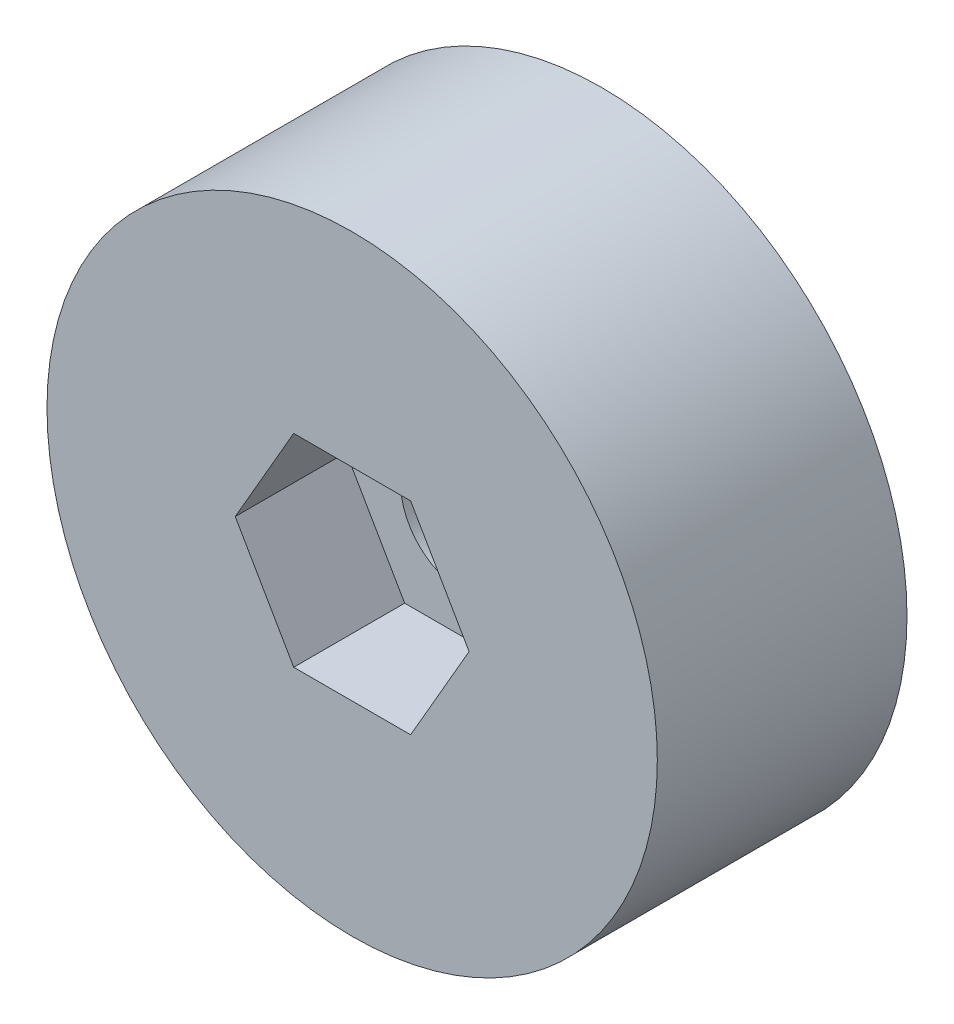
ISO-10303-21;
HEADER;
FILE_DESCRIPTION(('STEP AP214'),'2;1');
FILE_NAME('part.step','',(''),(''),'','','');
FILE_SCHEMA(('AUTOMOTIVE_DESIGN { 1 0 10303 214 1 1 1 1 }'));
ENDSEC;
DATA;
#1=APPLICATION_CONTEXT('core data for automotive mechanical design processes');
#2=APPLICATION_PROTOCOL_DEFINITION('international standard','automotive_design',2000,#1);
#3=PRODUCT_CONTEXT('',#1,'mechanical');
#4=PRODUCT('Part','Part','',(#3));
#5=PRODUCT_RELATED_PRODUCT_CATEGORY('part','',(#4));
#6=PRODUCT_DEFINITION_FORMATION('','',#4);
#7=PRODUCT_DEFINITION_CONTEXT('part definition',#1,'design');
#8=PRODUCT_DEFINITION('design','',#6,#7);
#9=PRODUCT_DEFINITION_SHAPE('','',#8);
#10=(LENGTH_UNIT() NAMED_UNIT(*) SI_UNIT(.MILLI.,.METRE.));
#11=(NAMED_UNIT(*) PLANE_ANGLE_UNIT() SI_UNIT($,.RADIAN.));
#12=(NAMED_UNIT(*) SI_UNIT($,.STERADIAN.) SOLID_ANGLE_UNIT());
#13=UNCERTAINTY_MEASURE_WITH_UNIT(LENGTH_MEASURE(1.E-05),#10,'distance_accuracy_value','');
#14=(GEOMETRIC_REPRESENTATION_CONTEXT(3) GLOBAL_UNCERTAINTY_ASSIGNED_CONTEXT((#13)) GLOBAL_UNIT_ASSIGNED_CONTEXT((#10,
#11,#12)) REPRESENTATION_CONTEXT('',''));
#15=CARTESIAN_POINT('',(0.,0.,0.));
#16=DIRECTION('',(0.,0.,1.));
#17=DIRECTION('',(1.,0.,0.));
#18=AXIS2_PLACEMENT_3D('',#15,#16,#17);
#19=CARTESIAN_POINT('',(0.,0.,5.));
#20=DIRECTION('',(0.,0.,1.));
#21=DIRECTION('',(1.,0.,0.));
#22=AXIS2_PLACEMENT_3D('',#19,#20,#21);
#23=PLANE('',#22);
#24=CARTESIAN_POINT('',(0.,0.,5.));
#25=DIRECTION('',(0.,0.,1.));
#26=DIRECTION('',(1.,0.,0.));
#27=AXIS2_PLACEMENT_3D('',#24,#25,#26);
#28=CIRCLE('',#27,2.25);
#29=CARTESIAN_POINT('',(2.25,0.,5.));
#30=VERTEX_POINT('',#29);
#31=EDGE_CURVE('E51',#30,#30,#28,.T.);
#32=ORIENTED_EDGE('',*,*,#31,.F.);
#33=EDGE_LOOP('',(#32));
#34=FACE_BOUND('',#33,.T.);
#35=DIRECTION('',(1.,0.,0.));
#36=VECTOR('',#35,1.);
#37=CARTESIAN_POINT('',(-2.10732848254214,-3.65,5.));
#38=LINE('',#37,#36);
#39=CARTESIAN_POINT('',(-2.10732848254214,-3.65,5.));
#40=VERTEX_POINT('',#39);
#41=CARTESIAN_POINT('',(2.10732848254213,-3.65,5.));
#42=VERTEX_POINT('',#41);
#43=EDGE_CURVE('E104',#40,#42,#38,.T.);
#44=ORIENTED_EDGE('',*,*,#43,.T.);
#45=DIRECTION('',(0.5,0.866025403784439,0.));
#46=VECTOR('',#45,1.);
#47=CARTESIAN_POINT('',(2.10732848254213,-3.65,5.));
#48=LINE('',#47,#46);
#49=CARTESIAN_POINT('',(4.21465696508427,0.,5.));
#50=VERTEX_POINT('',#49);
#51=EDGE_CURVE('E127',#42,#50,#48,.T.);
#52=ORIENTED_EDGE('',*,*,#51,.T.);
#53=DIRECTION('',(-0.5,0.866025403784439,0.));
#54=VECTOR('',#53,1.);
#55=CARTESIAN_POINT('',(4.21465696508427,0.,5.));
#56=LINE('',#55,#54);
#57=CARTESIAN_POINT('',(2.10732848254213,3.65,5.));
#58=VERTEX_POINT('',#57);
#59=EDGE_CURVE('E110',#50,#58,#56,.T.);
#60=ORIENTED_EDGE('',*,*,#59,.T.);
#61=DIRECTION('',(-1.,0.,0.));
#62=VECTOR('',#61,1.);
#63=CARTESIAN_POINT('',(2.10732848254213,3.65,5.));
#64=LINE('',#63,#62);
#65=CARTESIAN_POINT('',(-2.10732848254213,3.65,5.));
#66=VERTEX_POINT('',#65);
#67=EDGE_CURVE('E130',#58,#66,#64,.T.);
#68=ORIENTED_EDGE('',*,*,#67,.T.);
#69=DIRECTION('',(-0.5,-0.866025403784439,0.));
#70=VECTOR('',#69,1.);
#71=CARTESIAN_POINT('',(-2.10732848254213,3.65,5.));
#72=LINE('',#71,#70);
#73=CARTESIAN_POINT('',(-4.21465696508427,0.,5.));
#74=VERTEX_POINT('',#73);
#75=EDGE_CURVE('E133',#66,#74,#72,.T.);
#76=ORIENTED_EDGE('',*,*,#75,.T.);
#77=DIRECTION('',(0.5,-0.866025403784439,0.));
#78=VECTOR('',#77,1.);
#79=CARTESIAN_POINT('',(-4.21465696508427,0.,5.));
#80=LINE('',#79,#78);
#81=EDGE_CURVE('E136',#74,#40,#80,.T.);
#82=ORIENTED_EDGE('',*,*,#81,.T.);
#83=EDGE_LOOP('',(#44,#52,#60,#68,#76,#82));
#84=FACE_BOUND('',#83,.T.);
#85=ADVANCED_FACE('F43',(#34,#84),#23,.T.);
#86=CARTESIAN_POINT('',(0.,0.,0.));
#87=DIRECTION('',(0.,0.,1.));
#88=DIRECTION('',(1.,0.,0.));
#89=AXIS2_PLACEMENT_3D('',#86,#87,#88);
#90=PLANE('',#89);
#91=CARTESIAN_POINT('',(0.,0.,0.));
#92=DIRECTION('',(0.,0.,1.));
#93=DIRECTION('',(1.,0.,0.));
#94=AXIS2_PLACEMENT_3D('',#91,#92,#93);
#95=CIRCLE('',#94,11.);
#96=CARTESIAN_POINT('',(11.,0.,0.));
#97=VERTEX_POINT('',#96);
#98=EDGE_CURVE('E11',#97,#97,#95,.T.);
#99=ORIENTED_EDGE('',*,*,#98,.F.);
#100=EDGE_LOOP('',(#99));
#101=FACE_BOUND('',#100,.T.);
#102=CARTESIAN_POINT('',(0.,0.,0.));
#103=DIRECTION('',(0.,0.,1.));
#104=DIRECTION('',(1.,0.,0.));
#105=AXIS2_PLACEMENT_3D('',#102,#103,#104);
#106=CIRCLE('',#105,2.25);
#107=CARTESIAN_POINT('',(2.25,0.,0.));
#108=VERTEX_POINT('',#107);
#109=EDGE_CURVE('E150',#108,#108,#106,.T.);
#110=ORIENTED_EDGE('',*,*,#109,.T.);
#111=EDGE_LOOP('',(#110));
#112=FACE_BOUND('',#111,.T.);
#113=ADVANCED_FACE('F155',(#101,#112),#90,.F.);
#114=CARTESIAN_POINT('',(0.,0.,5.));
#115=DIRECTION('',(0.,0.,-1.));
#116=DIRECTION('',(-1.,0.,0.));
#117=AXIS2_PLACEMENT_3D('',#114,#115,#116);
#118=CYLINDRICAL_SURFACE('',#117,11.);
#119=ORIENTED_EDGE('',*,*,#98,.T.);
#120=EDGE_LOOP('',(#119));
#121=FACE_BOUND('',#120,.T.);
#122=CARTESIAN_POINT('',(0.,0.,9.));
#123=DIRECTION('',(0.,0.,1.));
#124=DIRECTION('',(1.,0.,0.));
#125=AXIS2_PLACEMENT_3D('',#122,#123,#124);
#126=CIRCLE('',#125,11.);
#127=CARTESIAN_POINT('',(11.,0.,9.));
#128=VERTEX_POINT('',#127);
#129=EDGE_CURVE('E111',#128,#128,#126,.T.);
#130=ORIENTED_EDGE('',*,*,#129,.F.);
#131=EDGE_LOOP('',(#130));
#132=FACE_BOUND('',#131,.T.);
#133=ADVANCED_FACE('F45',(#121,#132),#118,.T.);
#134=CARTESIAN_POINT('',(0.,0.,5.));
#135=DIRECTION('',(0.,0.,-1.));
#136=DIRECTION('',(-1.,0.,0.));
#137=AXIS2_PLACEMENT_3D('',#134,#135,#136);
#138=CYLINDRICAL_SURFACE('',#137,2.25);
#139=ORIENTED_EDGE('',*,*,#31,.T.);
#140=EDGE_LOOP('',(#139));
#141=FACE_BOUND('',#140,.T.);
#142=ORIENTED_EDGE('',*,*,#109,.F.);
#143=EDGE_LOOP('',(#142));
#144=FACE_BOUND('',#143,.T.);
#145=ADVANCED_FACE('F157',(#141,#144),#138,.F.);
#146=CARTESIAN_POINT('',(0.,0.,9.));
#147=DIRECTION('',(0.,0.,1.));
#148=DIRECTION('',(1.,0.,0.));
#149=AXIS2_PLACEMENT_3D('',#146,#147,#148);
#150=PLANE('',#149);
#151=ORIENTED_EDGE('',*,*,#129,.T.);
#152=EDGE_LOOP('',(#151));
#153=FACE_BOUND('',#152,.T.);
#154=DIRECTION('',(-0.5,0.866025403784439,0.));
#155=VECTOR('',#154,1.);
#156=CARTESIAN_POINT('',(4.21465696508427,0.,9.));
#157=LINE('',#156,#155);
#158=CARTESIAN_POINT('',(4.21465696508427,0.,9.));
#159=VERTEX_POINT('',#158);
#160=CARTESIAN_POINT('',(2.10732848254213,3.65,9.));
#161=VERTEX_POINT('',#160);
#162=EDGE_CURVE('E103',#159,#161,#157,.T.);
#163=ORIENTED_EDGE('',*,*,#162,.F.);
#164=DIRECTION('',(0.5,0.866025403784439,0.));
#165=VECTOR('',#164,1.);
#166=CARTESIAN_POINT('',(2.10732848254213,-3.65,9.));
#167=LINE('',#166,#165);
#168=CARTESIAN_POINT('',(2.10732848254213,-3.65,9.));
#169=VERTEX_POINT('',#168);
#170=EDGE_CURVE('E95',#169,#159,#167,.T.);
#171=ORIENTED_EDGE('',*,*,#170,.F.);
#172=DIRECTION('',(1.,0.,0.));
#173=VECTOR('',#172,1.);
#174=CARTESIAN_POINT('',(-2.10732848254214,-3.65,9.));
#175=LINE('',#174,#173);
#176=CARTESIAN_POINT('',(-2.10732848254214,-3.65,9.));
#177=VERTEX_POINT('',#176);
#178=EDGE_CURVE('E125',#177,#169,#175,.T.);
#179=ORIENTED_EDGE('',*,*,#178,.F.);
#180=DIRECTION('',(0.5,-0.866025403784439,0.));
#181=VECTOR('',#180,1.);
#182=CARTESIAN_POINT('',(-4.21465696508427,0.,9.));
#183=LINE('',#182,#181);
#184=CARTESIAN_POINT('',(-4.21465696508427,0.,9.));
#185=VERTEX_POINT('',#184);
#186=EDGE_CURVE('E123',#185,#177,#183,.T.);
#187=ORIENTED_EDGE('',*,*,#186,.F.);
#188=DIRECTION('',(-0.5,-0.866025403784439,0.));
#189=VECTOR('',#188,1.);
#190=CARTESIAN_POINT('',(-2.10732848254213,3.65,9.));
#191=LINE('',#190,#189);
#192=CARTESIAN_POINT('',(-2.10732848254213,3.65,9.));
#193=VERTEX_POINT('',#192);
#194=EDGE_CURVE('E119',#193,#185,#191,.T.);
#195=ORIENTED_EDGE('',*,*,#194,.F.);
#196=DIRECTION('',(-1.,0.,0.));
#197=VECTOR('',#196,1.);
#198=CARTESIAN_POINT('',(2.10732848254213,3.65,9.));
#199=LINE('',#198,#197);
#200=EDGE_CURVE('E117',#161,#193,#199,.T.);
#201=ORIENTED_EDGE('',*,*,#200,.F.);
#202=EDGE_LOOP('',(#163,#171,#179,#187,#195,#201));
#203=FACE_BOUND('',#202,.T.);
#204=ADVANCED_FACE('F115',(#153,#203),#150,.T.);
#205=CARTESIAN_POINT('',(2.10732848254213,-3.65,9.));
#206=DIRECTION('',(-0.866025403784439,0.5,0.));
#207=DIRECTION('',(-0.5,-0.866025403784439,0.));
#208=AXIS2_PLACEMENT_3D('',#205,#206,#207);
#209=PLANE('',#208);
#210=ORIENTED_EDGE('',*,*,#51,.F.);
#211=DIRECTION('',(0.,0.,-1.));
#212=VECTOR('',#211,1.);
#213=CARTESIAN_POINT('',(2.10732848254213,-3.65,9.));
#214=LINE('',#213,#212);
#215=EDGE_CURVE('E58',#169,#42,#214,.T.);
#216=ORIENTED_EDGE('',*,*,#215,.F.);
#217=ORIENTED_EDGE('',*,*,#170,.T.);
#218=DIRECTION('',(0.,0.,-1.));
#219=VECTOR('',#218,1.);
#220=CARTESIAN_POINT('',(4.21465696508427,0.,9.));
#221=LINE('',#220,#219);
#222=EDGE_CURVE('E98',#159,#50,#221,.T.);
#223=ORIENTED_EDGE('',*,*,#222,.T.);
#224=EDGE_LOOP('',(#210,#216,#217,#223));
#225=FACE_BOUND('',#224,.T.);
#226=ADVANCED_FACE('F97',(#225),#209,.T.);
#227=CARTESIAN_POINT('',(4.21465696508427,0.,9.));
#228=DIRECTION('',(-0.866025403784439,-0.5,0.));
#229=DIRECTION('',(0.5,-0.866025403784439,0.));
#230=AXIS2_PLACEMENT_3D('',#227,#228,#229);
#231=PLANE('',#230);
#232=ORIENTED_EDGE('',*,*,#59,.F.);
#233=ORIENTED_EDGE('',*,*,#222,.F.);
#234=ORIENTED_EDGE('',*,*,#162,.T.);
#235=DIRECTION('',(0.,0.,-1.));
#236=VECTOR('',#235,1.);
#237=CARTESIAN_POINT('',(2.10732848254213,3.65,9.));
#238=LINE('',#237,#236);
#239=EDGE_CURVE('E112',#161,#58,#238,.T.);
#240=ORIENTED_EDGE('',*,*,#239,.T.);
#241=EDGE_LOOP('',(#232,#233,#234,#240));
#242=FACE_BOUND('',#241,.T.);
#243=ADVANCED_FACE('F107',(#242),#231,.T.);
#244=CARTESIAN_POINT('',(2.10732848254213,3.65,9.));
#245=DIRECTION('',(0.,-1.,0.));
#246=DIRECTION('',(1.,0.,0.));
#247=AXIS2_PLACEMENT_3D('',#244,#245,#246);
#248=PLANE('',#247);
#249=ORIENTED_EDGE('',*,*,#67,.F.);
#250=ORIENTED_EDGE('',*,*,#239,.F.);
#251=ORIENTED_EDGE('',*,*,#200,.T.);
#252=DIRECTION('',(0.,0.,-1.));
#253=VECTOR('',#252,1.);
#254=CARTESIAN_POINT('',(-2.10732848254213,3.65,9.));
#255=LINE('',#254,#253);
#256=EDGE_CURVE('E145',#193,#66,#255,.T.);
#257=ORIENTED_EDGE('',*,*,#256,.T.);
#258=EDGE_LOOP('',(#249,#250,#251,#257));
#259=FACE_BOUND('',#258,.T.);
#260=ADVANCED_FACE('F191',(#259),#248,.T.);
#261=CARTESIAN_POINT('',(-2.10732848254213,3.65,9.));
#262=DIRECTION('',(0.866025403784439,-0.5,0.));
#263=DIRECTION('',(0.5,0.866025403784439,0.));
#264=AXIS2_PLACEMENT_3D('',#261,#262,#263);
#265=PLANE('',#264);
#266=ORIENTED_EDGE('',*,*,#75,.F.);
#267=ORIENTED_EDGE('',*,*,#256,.F.);
#268=ORIENTED_EDGE('',*,*,#194,.T.);
#269=DIRECTION('',(0.,0.,-1.));
#270=VECTOR('',#269,1.);
#271=CARTESIAN_POINT('',(-4.21465696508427,0.,9.));
#272=LINE('',#271,#270);
#273=EDGE_CURVE('E143',#185,#74,#272,.T.);
#274=ORIENTED_EDGE('',*,*,#273,.T.);
#275=EDGE_LOOP('',(#266,#267,#268,#274));
#276=FACE_BOUND('',#275,.T.);
#277=ADVANCED_FACE('F185',(#276),#265,.T.);
#278=CARTESIAN_POINT('',(-4.21465696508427,0.,9.));
#279=DIRECTION('',(0.866025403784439,0.5,0.));
#280=DIRECTION('',(-0.5,0.866025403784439,0.));
#281=AXIS2_PLACEMENT_3D('',#278,#279,#280);
#282=PLANE('',#281);
#283=ORIENTED_EDGE('',*,*,#81,.F.);
#284=ORIENTED_EDGE('',*,*,#273,.F.);
#285=ORIENTED_EDGE('',*,*,#186,.T.);
#286=DIRECTION('',(0.,0.,-1.));
#287=VECTOR('',#286,1.);
#288=CARTESIAN_POINT('',(-2.10732848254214,-3.65,9.));
#289=LINE('',#288,#287);
#290=EDGE_CURVE('E63',#177,#40,#289,.T.);
#291=ORIENTED_EDGE('',*,*,#290,.T.);
#292=EDGE_LOOP('',(#283,#284,#285,#291));
#293=FACE_BOUND('',#292,.T.);
#294=ADVANCED_FACE('F180',(#293),#282,.T.);
#295=CARTESIAN_POINT('',(-2.10732848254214,-3.65,9.));
#296=DIRECTION('',(0.,1.,0.));
#297=DIRECTION('',(-1.,0.,0.));
#298=AXIS2_PLACEMENT_3D('',#295,#296,#297);
#299=PLANE('',#298);
#300=ORIENTED_EDGE('',*,*,#43,.F.);
#301=ORIENTED_EDGE('',*,*,#290,.F.);
#302=ORIENTED_EDGE('',*,*,#178,.T.);
#303=ORIENTED_EDGE('',*,*,#215,.T.);
#304=EDGE_LOOP('',(#300,#301,#302,#303));
#305=FACE_BOUND('',#304,.T.);
#306=ADVANCED_FACE('F178',(#305),#299,.T.);
#307=CLOSED_SHELL('',(#85,#113,#133,#145,#204,#226,#243,#260,#277,#294,#306));
#308=MANIFOLD_SOLID_BREP('B2',#307);
#309=ADVANCED_BREP_SHAPE_REPRESENTATION('',(#18,#308),#14);
#310=SHAPE_DEFINITION_REPRESENTATION(#9,#309);
ENDSEC;
END-ISO-10303-21;
